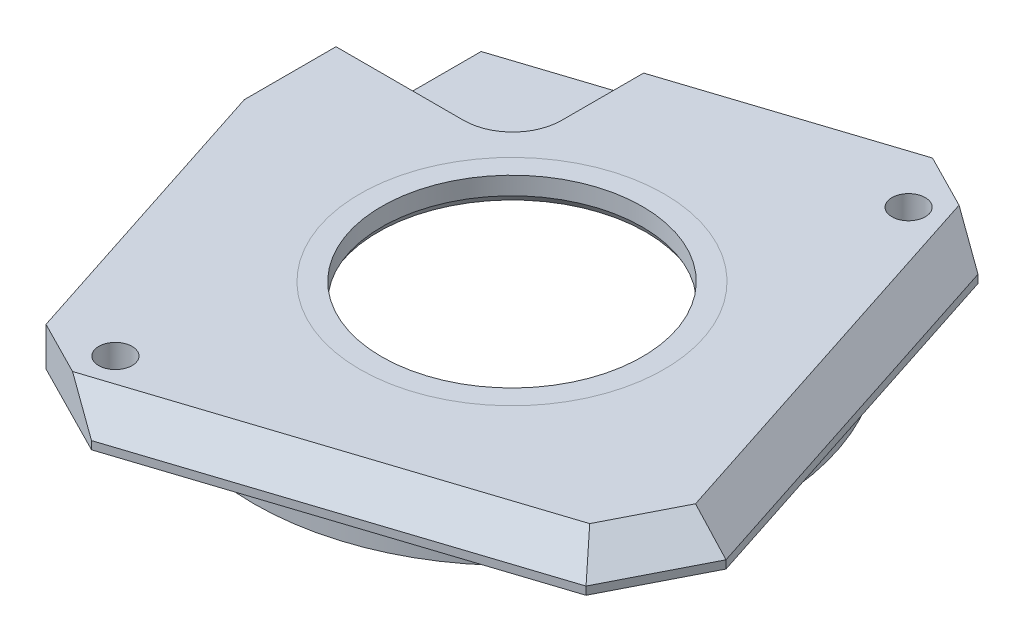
from build123d import *

# Parameters (mm, degrees)
SKETCH1_R           = 40.64
SKETCH1_R_2         = 13.49375
SKETCH1_R_3         = 1.7272
BOSS_EXTRUDE1_DEPTH = 4.00558
SKETCH3_R           = 21.59
CUT_EXTRUDE1_DEPTH  = 1.524
BOSS_EXTRUDE2_START = 2.54
SKETCH7_R           = 26.745999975
SKETCH7_R_2         = 21.59
BOSS_EXTRUDE2_DEPTH = 2.54
CUT_EXTRUDE2_REACH  = 59.845
SKETCH5_R           = 71.94317269
CHAMFER1_SIZE       = 7.62
CHAMFER2_SIZE       = 3.175
FILLET2_R           = 2.54
SKETCH8_W           = 21.349414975
SKETCH8_H           = 19.709616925
CUT_EXTRUDE3_DEPTH  = 2.35458
FILLET3_R           = 5.08
SKETCH9_W           = 5.588
SKETCH9_H           = 11.69832168
CUT_EXTRUDE4_DEPTH  = 1.651
CHAMFER3_SIZE       = 0.635
CHAMFER3_SIZE2      = 0.366617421


with BuildPart() as part:
    # Sketch1 → Boss-Extrude1 (new body)
    with BuildSketch(Plane(origin=(0, 0, 0), x_dir=(1, 0, 0), z_dir=(0, 1, 0))):
        with Locations(Location((0, 0, 0), (0, 0, 270))):
            Circle(SKETCH1_R)
        with Locations(Location((0, 0, 0), (0, 0, 270))):
            Circle(SKETCH1_R_2, mode=Mode.SUBTRACT)
        with Locations(Location((13.861633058, 27.204932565, 0), (0, 0, 270))):
            Circle(SKETCH1_R_3, mode=Mode.SUBTRACT)
        with Locations(Location((-13.861633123, -27.205041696, 0), (0, 0, 270))):
            Circle(SKETCH1_R_3, mode=Mode.SUBTRACT)
    extrude(amount=BOSS_EXTRUDE1_DEPTH)

    # Sketch3 → Cut-Extrude1 (cut)
    with BuildSketch(Plane.XZ):
        with Locations(Location((0, 0, 0), (0, 0, 270))):
            Circle(SKETCH3_R)
    extrude(amount=-CUT_EXTRUDE1_DEPTH, mode=Mode.SUBTRACT)

    # Sketch7 → Boss-Extrude2 (add)
    with BuildSketch(Plane.XZ.offset(BOSS_EXTRUDE2_START)):
        with Locations(Location((0, 0, 0), (0, 0, 90))):
            Circle(SKETCH7_R)
        with Locations(Location((0, 0, 0), (0, 0, 270))):
            Circle(SKETCH7_R_2, mode=Mode.SUBTRACT)
    extrude(amount=-BOSS_EXTRUDE2_DEPTH)

    # Sketch5 → Cut-Extrude2 (cut, up to next)
    with BuildSketch(Plane(origin=(0, 4.00558, 0), x_dir=(1, 0, 0), z_dir=(0, 1, 0)), mode=Mode.PRIVATE) as cut_extrude2_sk1:
        Circle(SKETCH5_R)
        Polygon((-30.175, 2.453361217), (-17.938584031, -35.206453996), (35.206453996, -17.938584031), (17.938584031, 35.206453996), (-10.236199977, 26.051911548), (-30.175, 19.573402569), (-30.175, 11.112445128), align=None, mode=Mode.SUBTRACT)
    cut_extrude2_tool1 = extrude(cut_extrude2_sk1.sketch, amount=-CUT_EXTRUDE2_REACH, mode=Mode.PRIVATE) & part.part
    add(cut_extrude2_tool1.solids().sort_by_distance((-69.908312, 4.00558, 0))[0], mode=Mode.SUBTRACT)

    # Chamfer1
    chamfer1_edges = [part.edges().sort_by_distance(p)[0] for p in [
        (17.938584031, 2.00279, -35.206453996),
        (35.206453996, 2.00279, 17.938584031),
        (-17.938584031, 2.00279, 35.206453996),
    ]]
    chamfer(chamfer1_edges, length=CHAMFER1_SIZE)

    # Chamfer2
    chamfer2_edges = [part.edges().sort_by_distance(p)[0] for p in [
        (26.572519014, 4.00558, -8.633934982),
        (8.633934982, 4.00558, 26.572519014),
        (30.405573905, 4.00558, 15.492413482),
    ]]
    chamfer(chamfer2_edges, length=CHAMFER2_SIZE)

    # Fillet2
    fillet2_edges = [part.edges().sort_by_distance(p)[0] for p in [
        (0, 1.524, 21.59),
    ]]
    fillet(fillet2_edges, radius=FILLET2_R)

    # Sketch8 → Cut-Extrude3 (cut)
    with BuildSketch(Plane(origin=(0, 4.00558, 0), x_dir=(1, 0, 0), z_dir=(0, 1, 0))):
        with Locations((-22.561707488, 21.808211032)):
            Rectangle(SKETCH8_W, SKETCH8_H)
    extrude(amount=-CUT_EXTRUDE3_DEPTH, mode=Mode.SUBTRACT)

    # Fillet3
    fillet3_edges = [part.edges().sort_by_distance(p)[0] for p in [
        (-11.887, 2.82829, -11.953402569),
    ]]
    fillet(fillet3_edges, radius=FILLET3_R)

    # Sketch9 → Cut-Extrude4 (cut)
    with BuildSketch(Plane(origin=(0, 1.651, 0), x_dir=(1, 0, 0), z_dir=(0, 1, 0))):
        with Locations((-27.381, 17.802563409)):
            Rectangle(SKETCH9_W, SKETCH9_H)
    extrude(amount=-CUT_EXTRUDE4_DEPTH, mode=Mode.SUBTRACT)

    # Chamfer3
    chamfer3_edges = [part.edges().sort_by_distance(p)[0] for p in [
        (0, 1.524, -13.49375),
    ]]
    chamfer3_side = [part.faces().sort_by_distance(p)[0] for p in [
        (0, 2.76479, -13.49375),
    ]]
    chamfer(chamfer3_edges, length=CHAMFER3_SIZE, length2=CHAMFER3_SIZE2, reference=chamfer3_side[0])


solid = part.part
